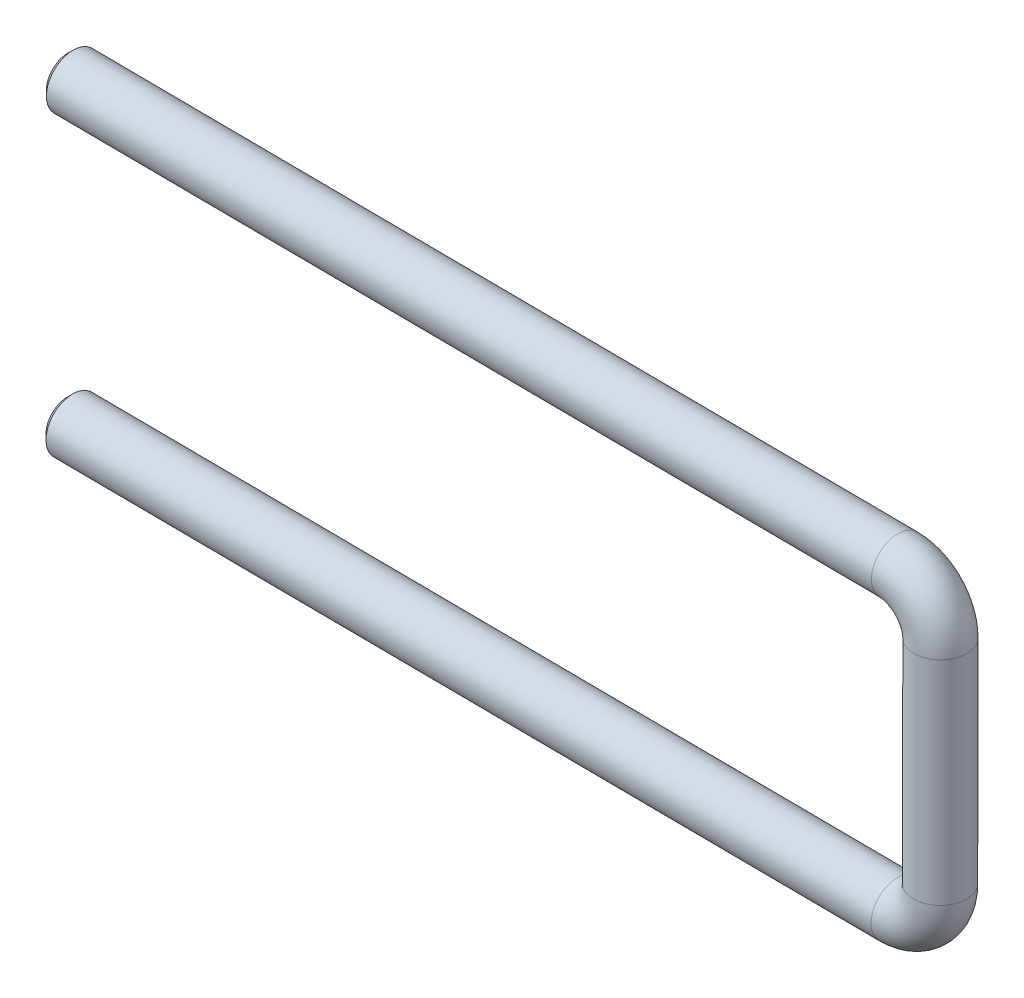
ISO-10303-21;
HEADER;
FILE_DESCRIPTION(('STEP AP214'),'2;1');
FILE_NAME('part.step','',(''),(''),'','','');
FILE_SCHEMA(('AUTOMOTIVE_DESIGN { 1 0 10303 214 1 1 1 1 }'));
ENDSEC;
DATA;
#1=APPLICATION_CONTEXT('core data for automotive mechanical design processes');
#2=APPLICATION_PROTOCOL_DEFINITION('international standard','automotive_design',2000,#1);
#3=PRODUCT_CONTEXT('',#1,'mechanical');
#4=PRODUCT('Part','Part','',(#3));
#5=PRODUCT_RELATED_PRODUCT_CATEGORY('part','',(#4));
#6=PRODUCT_DEFINITION_FORMATION('','',#4);
#7=PRODUCT_DEFINITION_CONTEXT('part definition',#1,'design');
#8=PRODUCT_DEFINITION('design','',#6,#7);
#9=PRODUCT_DEFINITION_SHAPE('','',#8);
#10=(LENGTH_UNIT() NAMED_UNIT(*) SI_UNIT(.MILLI.,.METRE.));
#11=(NAMED_UNIT(*) PLANE_ANGLE_UNIT() SI_UNIT($,.RADIAN.));
#12=(NAMED_UNIT(*) SI_UNIT($,.STERADIAN.) SOLID_ANGLE_UNIT());
#13=UNCERTAINTY_MEASURE_WITH_UNIT(LENGTH_MEASURE(1.E-05),#10,'distance_accuracy_value','');
#14=(GEOMETRIC_REPRESENTATION_CONTEXT(3) GLOBAL_UNCERTAINTY_ASSIGNED_CONTEXT((#13)) GLOBAL_UNIT_ASSIGNED_CONTEXT((#10,
#11,#12)) REPRESENTATION_CONTEXT('',''));
#15=CARTESIAN_POINT('',(0.,0.,0.));
#16=DIRECTION('',(0.,0.,1.));
#17=DIRECTION('',(1.,0.,0.));
#18=AXIS2_PLACEMENT_3D('',#15,#16,#17);
#19=CARTESIAN_POINT('',(-44.9011082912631,12.119800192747,16.0056169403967));
#20=DIRECTION('',(-0.999980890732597,0.0014045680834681,-0.00602041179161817));
#21=DIRECTION('',(-0.00602041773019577,0.,0.999981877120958));
#22=AXIS2_PLACEMENT_3D('',#19,#20,#21);
#23=PLANE('',#22);
#24=CARTESIAN_POINT('',(-44.9011082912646,12.119800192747,16.0056169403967));
#25=DIRECTION('',(0.999980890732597,-0.00140456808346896,0.00602041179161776));
#26=DIRECTION('',(0.00602041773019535,0.,-0.999981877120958));
#27=AXIS2_PLACEMENT_3D('',#24,#25,#26);
#28=CIRCLE('',#27,2.00000000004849);
#29=CARTESIAN_POINT('',(-44.8890674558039,12.119800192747,14.0056531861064));
#30=VERTEX_POINT('',#29);
#31=EDGE_CURVE('E16',#30,#30,#28,.T.);
#32=ORIENTED_EDGE('',*,*,#31,.F.);
#33=EDGE_LOOP('',(#32));
#34=FACE_BOUND('',#33,.T.);
#35=ADVANCED_FACE('F12',(#34),#23,.T.);
#36=CARTESIAN_POINT('',(-44.4011178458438,12.1190979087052,16.0086271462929));
#37=DIRECTION('',(0.999980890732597,-0.00140456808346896,0.00602041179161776));
#38=DIRECTION('',(0.00602041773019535,0.,-0.999981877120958));
#39=AXIS2_PLACEMENT_3D('',#36,#37,#38);
#40=CONICAL_SURFACE('',#39,2.50000000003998,0.785398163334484);
#41=CARTESIAN_POINT('',(-44.4011178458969,12.1190979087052,16.0086271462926));
#42=DIRECTION('',(-0.999980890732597,0.0014045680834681,-0.00602041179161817));
#43=DIRECTION('',(-0.00602041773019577,0.,0.999981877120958));
#44=AXIS2_PLACEMENT_3D('',#41,#42,#43);
#45=CIRCLE('',#44,2.5);
#46=CARTESIAN_POINT('',(-44.3860668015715,12.1190979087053,13.5086724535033));
#47=VERTEX_POINT('',#46);
#48=EDGE_CURVE('E37',#47,#47,#45,.F.);
#49=CARTESIAN_POINT('',(-44.3860668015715,12.1190979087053,13.5086724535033));
#50=CARTESIAN_POINT('',(-44.3913063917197,12.119105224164,13.5138493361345));
#51=CARTESIAN_POINT('',(-44.396545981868,12.1191125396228,13.5190262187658));
#52=CARTESIAN_POINT('',(-44.4070251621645,12.1191271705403,13.5293799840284));
#53=CARTESIAN_POINT('',(-44.4122647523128,12.1191344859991,13.5345568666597));
#54=CARTESIAN_POINT('',(-44.4227439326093,12.1191491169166,13.5449106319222));
#55=CARTESIAN_POINT('',(-44.4279835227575,12.1191564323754,13.5500875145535));
#56=CARTESIAN_POINT('',(-44.438462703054,12.1191710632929,13.5604412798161));
#57=CARTESIAN_POINT('',(-44.4437022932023,12.1191783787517,13.5656181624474));
#58=CARTESIAN_POINT('',(-44.4541814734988,12.1191930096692,13.5759719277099));
#59=CARTESIAN_POINT('',(-44.459421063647,12.119200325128,13.5811488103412));
#60=CARTESIAN_POINT('',(-44.4699002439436,12.1192149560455,13.5915025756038));
#61=CARTESIAN_POINT('',(-44.4751398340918,12.1192222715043,13.5966794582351));
#62=CARTESIAN_POINT('',(-44.4856190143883,12.1192369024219,13.6070332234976));
#63=CARTESIAN_POINT('',(-44.4908586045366,12.1192442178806,13.6122101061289));
#64=CARTESIAN_POINT('',(-44.5013377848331,12.1192588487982,13.6225638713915));
#65=CARTESIAN_POINT('',(-44.5065773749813,12.1192661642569,13.6277407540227));
#66=CARTESIAN_POINT('',(-44.5170565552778,12.1192807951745,13.6380945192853));
#67=CARTESIAN_POINT('',(-44.5222961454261,12.1192881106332,13.6432714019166));
#68=CARTESIAN_POINT('',(-44.5327753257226,12.1193027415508,13.6536251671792));
#69=CARTESIAN_POINT('',(-44.5380149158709,12.1193100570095,13.6588020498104));
#70=CARTESIAN_POINT('',(-44.5484940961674,12.1193246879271,13.669155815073));
#71=CARTESIAN_POINT('',(-44.5537336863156,12.1193320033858,13.6743326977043));
#72=CARTESIAN_POINT('',(-44.5642128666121,12.1193466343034,13.6846864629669));
#73=CARTESIAN_POINT('',(-44.5694524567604,12.1193539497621,13.6898633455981));
#74=CARTESIAN_POINT('',(-44.5799316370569,12.1193685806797,13.7002171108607));
#75=CARTESIAN_POINT('',(-44.5851712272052,12.1193758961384,13.705393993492));
#76=CARTESIAN_POINT('',(-44.5956504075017,12.119390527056,13.7157477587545));
#77=CARTESIAN_POINT('',(-44.6008899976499,12.1193978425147,13.7209246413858));
#78=CARTESIAN_POINT('',(-44.6113691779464,12.1194124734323,13.7312784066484));
#79=CARTESIAN_POINT('',(-44.6166087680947,12.1194197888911,13.7364552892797));
#80=CARTESIAN_POINT('',(-44.6270879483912,12.1194344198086,13.7468090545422));
#81=CARTESIAN_POINT('',(-44.6323275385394,12.1194417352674,13.7519859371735));
#82=CARTESIAN_POINT('',(-44.642806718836,12.1194563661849,13.7623397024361));
#83=CARTESIAN_POINT('',(-44.6480463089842,12.1194636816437,13.7675165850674));
#84=CARTESIAN_POINT('',(-44.6585254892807,12.1194783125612,13.7778703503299));
#85=CARTESIAN_POINT('',(-44.663765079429,12.11948562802,13.7830472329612));
#86=CARTESIAN_POINT('',(-44.6742442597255,12.1195002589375,13.7934009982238));
#87=CARTESIAN_POINT('',(-44.6794838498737,12.1195075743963,13.7985778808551));
#88=CARTESIAN_POINT('',(-44.6899630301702,12.1195222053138,13.8089316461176));
#89=CARTESIAN_POINT('',(-44.6952026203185,12.1195295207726,13.8141085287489));
#90=CARTESIAN_POINT('',(-44.705681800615,12.1195441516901,13.8244622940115));
#91=CARTESIAN_POINT('',(-44.7109213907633,12.1195514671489,13.8296391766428));
#92=CARTESIAN_POINT('',(-44.7214005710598,12.1195660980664,13.8399929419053));
#93=CARTESIAN_POINT('',(-44.726640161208,12.1195734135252,13.8451698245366));
#94=CARTESIAN_POINT('',(-44.7371193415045,12.1195880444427,13.8555235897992));
#95=CARTESIAN_POINT('',(-44.7423589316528,12.1195953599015,13.8607004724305));
#96=CARTESIAN_POINT('',(-44.7528381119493,12.119609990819,13.871054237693));
#97=CARTESIAN_POINT('',(-44.7580777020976,12.1196173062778,13.8762311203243));
#98=CARTESIAN_POINT('',(-44.7685568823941,12.1196319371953,13.8865848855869));
#99=CARTESIAN_POINT('',(-44.7737964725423,12.1196392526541,13.8917617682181));
#100=CARTESIAN_POINT('',(-44.7842756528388,12.1196538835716,13.9021155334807));
#101=CARTESIAN_POINT('',(-44.7895152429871,12.1196611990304,13.907292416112));
#102=CARTESIAN_POINT('',(-44.7999944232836,12.1196758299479,13.9176461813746));
#103=CARTESIAN_POINT('',(-44.8052340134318,12.1196831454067,13.9228230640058));
#104=CARTESIAN_POINT('',(-44.8157131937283,12.1196977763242,13.9331768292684));
#105=CARTESIAN_POINT('',(-44.8209527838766,12.119705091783,13.9383537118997));
#106=CARTESIAN_POINT('',(-44.8314319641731,12.1197197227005,13.9487074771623));
#107=CARTESIAN_POINT('',(-44.8366715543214,12.1197270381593,13.9538843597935));
#108=CARTESIAN_POINT('',(-44.8471507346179,12.1197416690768,13.9642381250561));
#109=CARTESIAN_POINT('',(-44.8523903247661,12.1197489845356,13.9694150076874));
#110=CARTESIAN_POINT('',(-44.8628695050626,12.1197636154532,13.97976877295));
#111=CARTESIAN_POINT('',(-44.8681090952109,12.1197709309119,13.9849456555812));
#112=CARTESIAN_POINT('',(-44.8785882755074,12.1197855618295,13.9952994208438));
#113=CARTESIAN_POINT('',(-44.8838278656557,12.1197928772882,14.0004763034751));
#114=CARTESIAN_POINT('',(-44.8890674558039,12.119800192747,14.0056531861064));
#115=B_SPLINE_CURVE_WITH_KNOTS('',3,(#49,#50,#51,#52,#53,#54,#55,#56,#57,#58,#59,#60,#61,#62,
#63,#64,#65,#66,#67,#68,#69,#70,#71,#72,#73,#74,#75,#76,#77,#78,#79,#80,#81,#82,#83,#84,#85,#86,
#87,#88,#89,#90,#91,#92,#93,#94,#95,#96,#97,#98,#99,#100,#101,#102,#103,#104,#105,#106,#107,
#108,#109,#110,#111,#112,#113,#114),.UNSPECIFIED.,.F.,.F.,(4,2,2,2,2,2,2,2,2,2,2,2,2,2,2,2,2,2,
2,2,2,2,2,2,2,2,2,2,2,2,2,2,4),(0.,0.0220970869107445,0.0441941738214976,0.0662912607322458,
0.0883883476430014,0.11048543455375,0.132582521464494,0.154679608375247,0.176776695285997,
0.198873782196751,0.220970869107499,0.24306795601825,0.265165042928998,0.287262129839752,
0.309359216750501,0.331456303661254,0.353553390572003,0.375650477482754,0.397747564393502,
0.419844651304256,0.441941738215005,0.464038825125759,0.486135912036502,0.508232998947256,
0.530330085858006,0.55242717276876,0.574524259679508,0.596621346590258,0.618718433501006,
0.64081552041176,0.66291260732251,0.685009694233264,0.707106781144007),.UNSPECIFIED.);
#116=EDGE_CURVE('BSEAM110',#47,#30,#115,.T.);
#117=ORIENTED_EDGE('',*,*,#48,.F.);
#118=ORIENTED_EDGE('',*,*,#31,.T.);
#119=ORIENTED_EDGE('',*,*,#116,.T.);
#120=ORIENTED_EDGE('',*,*,#116,.F.);
#121=EDGE_LOOP('',(#117,#119,#118,#120));
#122=FACE_BOUND('',#121,.T.);
#123=ADVANCED_FACE('F110',(#122),#40,.T.);
#124=CARTESIAN_POINT('',(33.5973916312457,12.0095415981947,16.4782192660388));
#125=DIRECTION('',(-0.999980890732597,0.0014045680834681,-0.00602041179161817));
#126=DIRECTION('',(-0.00602041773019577,0.,0.999981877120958));
#127=AXIS2_PLACEMENT_3D('',#124,#125,#126);
#128=CYLINDRICAL_SURFACE('',#127,2.5);
#129=ORIENTED_EDGE('',*,*,#48,.T.);
#130=EDGE_LOOP('',(#129));
#131=FACE_BOUND('',#130,.T.);
#132=CARTESIAN_POINT('',(33.5973916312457,12.0095415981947,16.4782192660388));
#133=DIRECTION('',(0.999980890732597,-0.00140456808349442,0.00602041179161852));
#134=DIRECTION('',(0.00602041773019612,0.,-0.999981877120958));
#135=AXIS2_PLACEMENT_3D('',#132,#133,#134);
#136=CIRCLE('',#135,2.5);
#137=CARTESIAN_POINT('',(33.5938801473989,9.50954406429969,16.4782192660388));
#138=VERTEX_POINT('',#137);
#139=EDGE_CURVE('E34',#138,#138,#136,.T.);
#140=ORIENTED_EDGE('',*,*,#139,.F.);
#141=EDGE_LOOP('',(#140));
#142=FACE_BOUND('',#141,.T.);
#143=ADVANCED_FACE('F101',(#131,#142),#128,.T.);
#144=CARTESIAN_POINT('',(33.6030100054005,16.0095376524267,16.4782192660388));
#145=DIRECTION('',(-0.00602040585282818,8.45623149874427E-06,0.999981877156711));
#146=DIRECTION('',(0.999981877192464,0.,0.00602040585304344));
#147=AXIS2_PLACEMENT_3D('',#144,#145,#146);
#148=TOROIDAL_SURFACE('',#147,4.,2.5);
#149=CARTESIAN_POINT('',(37.6029335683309,16.0039193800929,16.5023009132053));
#150=DIRECTION('',(0.00140459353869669,0.999999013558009,0.));
#151=DIRECTION('',(-0.999999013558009,0.00140459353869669,0.));
#152=AXIS2_PLACEMENT_3D('',#149,#150,#151);
#153=CIRCLE('',#152,2.5);
#154=CARTESIAN_POINT('',(40.1028857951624,16.0004079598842,16.5173519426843));
#155=VERTEX_POINT('',#154);
#156=EDGE_CURVE('E31',#155,#155,#153,.T.);
#157=CARTESIAN_POINT('',(33.6030100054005,16.0095376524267,16.4782192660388));
#158=DIRECTION('',(-0.00602040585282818,8.45623149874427E-06,0.999981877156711));
#159=DIRECTION('',(0.999981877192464,0.,0.00602040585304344));
#160=AXIS2_PLACEMENT_3D('',#157,#158,#159);
#161=CIRCLE('',#160,6.5);
#162=EDGE_CURVE('',#138,#155,#161,.T.);
#163=ORIENTED_EDGE('',*,*,#139,.T.);
#164=ORIENTED_EDGE('',*,*,#156,.F.);
#165=ORIENTED_EDGE('',*,*,#162,.T.);
#166=ORIENTED_EDGE('',*,*,#162,.F.);
#167=EDGE_LOOP('',(#163,#165,#164,#166));
#168=FACE_BOUND('',#167,.T.);
#169=ADVANCED_FACE('F55',(#168),#148,.T.);
#170=CARTESIAN_POINT('',(37.6029335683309,16.0039193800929,16.5023009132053));
#171=DIRECTION('',(0.00140459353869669,0.999999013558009,0.));
#172=DIRECTION('',(-0.999999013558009,0.00140459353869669,0.));
#173=AXIS2_PLACEMENT_3D('',#170,#171,#172);
#174=CYLINDRICAL_SURFACE('',#173,2.5);
#175=CARTESIAN_POINT('',(37.6310254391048,36.0038996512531,16.5023009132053));
#176=DIRECTION('',(0.00140459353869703,0.999999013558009,0.));
#177=DIRECTION('',(-0.999999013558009,0.00140459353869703,0.));
#178=AXIS2_PLACEMENT_3D('',#175,#176,#177);
#179=CIRCLE('',#178,2.5);
#180=CARTESIAN_POINT('',(40.1309776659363,36.0003882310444,16.5173519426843));
#181=VERTEX_POINT('',#180);
#182=EDGE_CURVE('E28',#181,#181,#179,.T.);
#183=ORIENTED_EDGE('',*,*,#182,.F.);
#184=EDGE_LOOP('',(#183));
#185=FACE_BOUND('',#184,.T.);
#186=ORIENTED_EDGE('',*,*,#156,.T.);
#187=EDGE_LOOP('',(#186));
#188=FACE_BOUND('',#187,.T.);
#189=ADVANCED_FACE('F46',(#185,#188),#174,.T.);
#190=CARTESIAN_POINT('',(-44.8617796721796,40.1197725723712,16.0056169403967));
#191=DIRECTION('',(0.999980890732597,-0.00140456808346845,0.00602041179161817));
#192=DIRECTION('',(0.00602041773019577,0.,-0.999981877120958));
#193=AXIS2_PLACEMENT_3D('',#190,#191,#192);
#194=PLANE('',#193);
#195=CARTESIAN_POINT('',(-44.8617796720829,40.1197725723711,16.0056169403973));
#196=DIRECTION('',(0.999980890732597,-0.00140456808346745,0.00602041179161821));
#197=DIRECTION('',(0.00602041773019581,0.,-0.999981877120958));
#198=AXIS2_PLACEMENT_3D('',#195,#196,#197);
#199=CIRCLE('',#198,2.00000000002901);
#200=CARTESIAN_POINT('',(-44.8497388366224,40.1197725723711,14.0056531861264));
#201=VERTEX_POINT('',#200);
#202=EDGE_CURVE('E25',#201,#201,#199,.T.);
#203=ORIENTED_EDGE('',*,*,#202,.F.);
#204=EDGE_LOOP('',(#203));
#205=FACE_BOUND('',#204,.T.);
#206=ADVANCED_FACE('F44',(#205),#194,.F.);
#207=CARTESIAN_POINT('',(33.6311018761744,36.009517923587,16.4782192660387));
#208=DIRECTION('',(-0.00602040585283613,8.45623149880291E-06,0.999981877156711));
#209=DIRECTION('',(0.999981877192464,0.,0.00602040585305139));
#210=AXIS2_PLACEMENT_3D('',#207,#208,#209);
#211=TOROIDAL_SURFACE('',#210,4.,2.5);
#212=CARTESIAN_POINT('',(33.6367202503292,40.009513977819,16.4782192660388));
#213=DIRECTION('',(-0.999980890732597,0.0014045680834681,-0.00602041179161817));
#214=DIRECTION('',(-0.00602041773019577,0.,0.999981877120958));
#215=AXIS2_PLACEMENT_3D('',#212,#213,#214);
#216=CIRCLE('',#215,2.5);
#217=CARTESIAN_POINT('',(33.640231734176,42.509511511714,16.4782192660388));
#218=VERTEX_POINT('',#217);
#219=EDGE_CURVE('E20',#218,#218,#216,.T.);
#220=CARTESIAN_POINT('',(33.6311018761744,36.009517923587,16.4782192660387));
#221=DIRECTION('',(-0.00602040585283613,8.45623149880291E-06,0.999981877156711));
#222=DIRECTION('',(0.999981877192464,0.,0.00602040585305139));
#223=AXIS2_PLACEMENT_3D('',#220,#221,#222);
#224=CIRCLE('',#223,6.5);
#225=EDGE_CURVE('',#181,#218,#224,.T.);
#226=ORIENTED_EDGE('',*,*,#182,.T.);
#227=ORIENTED_EDGE('',*,*,#219,.F.);
#228=ORIENTED_EDGE('',*,*,#225,.T.);
#229=ORIENTED_EDGE('',*,*,#225,.F.);
#230=EDGE_LOOP('',(#226,#228,#227,#229));
#231=FACE_BOUND('',#230,.T.);
#232=ADVANCED_FACE('F14',(#231),#211,.T.);
#233=CARTESIAN_POINT('',(-44.3617892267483,40.1190702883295,16.0086271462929));
#234=DIRECTION('',(0.999980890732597,-0.00140456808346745,0.00602041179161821));
#235=DIRECTION('',(0.00602041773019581,0.,-0.999981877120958));
#236=AXIS2_PLACEMENT_3D('',#233,#234,#235);
#237=CONICAL_SURFACE('',#236,2.50000000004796,0.785398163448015);
#238=CARTESIAN_POINT('',(-44.3617892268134,40.1190702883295,16.0086271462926));
#239=DIRECTION('',(-0.999980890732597,0.0014045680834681,-0.00602041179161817));
#240=DIRECTION('',(-0.00602041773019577,0.,0.999981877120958));
#241=AXIS2_PLACEMENT_3D('',#238,#239,#240);
#242=CIRCLE('',#241,2.5);
#243=CARTESIAN_POINT('',(-44.346738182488,40.1190702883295,13.5086724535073));
#244=VERTEX_POINT('',#243);
#245=EDGE_CURVE('E8',#244,#244,#242,.F.);
#246=CARTESIAN_POINT('',(-44.346738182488,40.1190702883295,13.5086724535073));
#247=CARTESIAN_POINT('',(-44.3519777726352,40.1190776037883,13.5138493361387));
#248=CARTESIAN_POINT('',(-44.3572173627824,40.1190849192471,13.5190262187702));
#249=CARTESIAN_POINT('',(-44.3676965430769,40.1190995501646,13.5293799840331));
#250=CARTESIAN_POINT('',(-44.3729361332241,40.1191068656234,13.5345568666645));
#251=CARTESIAN_POINT('',(-44.3834153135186,40.1191214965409,13.5449106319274));
#252=CARTESIAN_POINT('',(-44.3886549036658,40.1191288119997,13.5500875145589));
#253=CARTESIAN_POINT('',(-44.3991340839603,40.1191434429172,13.5604412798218));
#254=CARTESIAN_POINT('',(-44.4043736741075,40.119150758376,13.5656181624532));
#255=CARTESIAN_POINT('',(-44.414852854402,40.1191653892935,13.5759719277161));
#256=CARTESIAN_POINT('',(-44.4200924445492,40.1191727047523,13.5811488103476));
#257=CARTESIAN_POINT('',(-44.4305716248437,40.1191873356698,13.5915025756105));
#258=CARTESIAN_POINT('',(-44.4358112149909,40.1191946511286,13.5966794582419));
#259=CARTESIAN_POINT('',(-44.4462903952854,40.1192092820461,13.6070332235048));
#260=CARTESIAN_POINT('',(-44.4515299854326,40.1192165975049,13.6122101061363));
#261=CARTESIAN_POINT('',(-44.4620091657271,40.1192312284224,13.6225638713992));
#262=CARTESIAN_POINT('',(-44.4672487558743,40.1192385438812,13.6277407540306));
#263=CARTESIAN_POINT('',(-44.4777279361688,40.1192531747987,13.6380945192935));
#264=CARTESIAN_POINT('',(-44.482967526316,40.1192604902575,13.643271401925));
#265=CARTESIAN_POINT('',(-44.4934467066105,40.119275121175,13.6536251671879));
#266=CARTESIAN_POINT('',(-44.4986862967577,40.1192824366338,13.6588020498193));
#267=CARTESIAN_POINT('',(-44.5091654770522,40.1192970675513,13.6691558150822));
#268=CARTESIAN_POINT('',(-44.5144050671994,40.1193043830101,13.6743326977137));
#269=CARTESIAN_POINT('',(-44.5248842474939,40.1193190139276,13.6846864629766));
#270=CARTESIAN_POINT('',(-44.5301238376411,40.1193263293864,13.689863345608));
#271=CARTESIAN_POINT('',(-44.5406030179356,40.1193409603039,13.7002171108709));
#272=CARTESIAN_POINT('',(-44.5458426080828,40.1193482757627,13.7053939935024));
#273=CARTESIAN_POINT('',(-44.5563217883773,40.1193629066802,13.7157477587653));
#274=CARTESIAN_POINT('',(-44.5615613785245,40.119370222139,13.7209246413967));
#275=CARTESIAN_POINT('',(-44.572040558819,40.1193848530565,13.7312784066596));
#276=CARTESIAN_POINT('',(-44.5772801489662,40.1193921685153,13.7364552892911));
#277=CARTESIAN_POINT('',(-44.5877593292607,40.1194067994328,13.746809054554));
#278=CARTESIAN_POINT('',(-44.5929989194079,40.1194141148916,13.7519859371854));
#279=CARTESIAN_POINT('',(-44.6034780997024,40.1194287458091,13.7623397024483));
#280=CARTESIAN_POINT('',(-44.6087176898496,40.1194360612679,13.7675165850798));
#281=CARTESIAN_POINT('',(-44.6191968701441,40.1194506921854,13.7778703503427));
#282=CARTESIAN_POINT('',(-44.6244364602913,40.1194580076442,13.7830472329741));
#283=CARTESIAN_POINT('',(-44.6349156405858,40.1194726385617,13.793400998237));
#284=CARTESIAN_POINT('',(-44.640155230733,40.1194799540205,13.7985778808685));
#285=CARTESIAN_POINT('',(-44.6506344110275,40.119494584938,13.8089316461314));
#286=CARTESIAN_POINT('',(-44.6558740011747,40.1195019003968,13.8141085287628));
#287=CARTESIAN_POINT('',(-44.6663531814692,40.1195165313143,13.8244622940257));
#288=CARTESIAN_POINT('',(-44.6715927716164,40.1195238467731,13.8296391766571));
#289=CARTESIAN_POINT('',(-44.6820719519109,40.1195384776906,13.83999294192));
#290=CARTESIAN_POINT('',(-44.6873115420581,40.1195457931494,13.8451698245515));
#291=CARTESIAN_POINT('',(-44.6977907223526,40.1195604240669,13.8555235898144));
#292=CARTESIAN_POINT('',(-44.7030303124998,40.1195677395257,13.8607004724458));
#293=CARTESIAN_POINT('',(-44.7135094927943,40.1195823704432,13.8710542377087));
#294=CARTESIAN_POINT('',(-44.7187490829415,40.119589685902,13.8762311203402));
#295=CARTESIAN_POINT('',(-44.729228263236,40.1196043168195,13.8865848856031));
#296=CARTESIAN_POINT('',(-44.7344678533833,40.1196116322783,13.8917617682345));
#297=CARTESIAN_POINT('',(-44.7449470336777,40.1196262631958,13.9021155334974));
#298=CARTESIAN_POINT('',(-44.750186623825,40.1196335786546,13.9072924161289));
#299=CARTESIAN_POINT('',(-44.7606658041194,40.1196482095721,13.9176461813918));
#300=CARTESIAN_POINT('',(-44.7659053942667,40.1196555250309,13.9228230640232));
#301=CARTESIAN_POINT('',(-44.7763845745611,40.1196701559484,13.9331768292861));
#302=CARTESIAN_POINT('',(-44.7816241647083,40.1196774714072,13.9383537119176));
#303=CARTESIAN_POINT('',(-44.7921033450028,40.1196921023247,13.9487074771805));
#304=CARTESIAN_POINT('',(-44.79734293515,40.1196994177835,13.9538843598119));
#305=CARTESIAN_POINT('',(-44.8078221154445,40.119714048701,13.9642381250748));
#306=CARTESIAN_POINT('',(-44.8130617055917,40.1197213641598,13.9694150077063));
#307=CARTESIAN_POINT('',(-44.8235408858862,40.1197359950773,13.9797687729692));
#308=CARTESIAN_POINT('',(-44.8287804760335,40.1197433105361,13.9849456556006));
#309=CARTESIAN_POINT('',(-44.8392596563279,40.1197579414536,13.9952994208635));
#310=CARTESIAN_POINT('',(-44.8444992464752,40.1197652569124,14.000476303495));
#311=CARTESIAN_POINT('',(-44.8497388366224,40.1197725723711,14.0056531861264));
#312=B_SPLINE_CURVE_WITH_KNOTS('',3,(#246,#247,#248,#249,#250,#251,#252,#253,#254,#255,#256,
#257,#258,#259,#260,#261,#262,#263,#264,#265,#266,#267,#268,#269,#270,#271,#272,#273,#274,#275,
#276,#277,#278,#279,#280,#281,#282,#283,#284,#285,#286,#287,#288,#289,#290,#291,#292,#293,#294,
#295,#296,#297,#298,#299,#300,#301,#302,#303,#304,#305,#306,#307,#308,#309,#310,#311),
.UNSPECIFIED.,.F.,.F.,(4,2,2,2,2,2,2,2,2,2,2,2,2,2,2,2,2,2,2,2,2,2,2,2,2,2,2,2,2,2,2,2,4),(0.,
0.0220970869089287,0.0441941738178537,0.0662912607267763,0.0883883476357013,0.11048543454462,
0.132582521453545,0.154679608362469,0.176776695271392,0.198873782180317,0.22097086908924,
0.243067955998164,0.265165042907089,0.287262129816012,0.309359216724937,0.33145630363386,
0.353553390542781,0.375650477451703,0.397747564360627,0.419844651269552,0.441941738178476,
0.464038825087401,0.486135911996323,0.508232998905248,0.530330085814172,0.552427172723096,
0.574524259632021,0.596621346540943,0.618718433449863,0.640815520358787,0.662912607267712,
0.685009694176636,0.707106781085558),.UNSPECIFIED.);
#313=EDGE_CURVE('BSEAM42',#244,#201,#312,.T.);
#314=ORIENTED_EDGE('',*,*,#245,.F.);
#315=ORIENTED_EDGE('',*,*,#202,.T.);
#316=ORIENTED_EDGE('',*,*,#313,.T.);
#317=ORIENTED_EDGE('',*,*,#313,.F.);
#318=EDGE_LOOP('',(#314,#316,#315,#317));
#319=FACE_BOUND('',#318,.T.);
#320=ADVANCED_FACE('F42',(#319),#237,.T.);
#321=CARTESIAN_POINT('',(33.6367202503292,40.009513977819,16.4782192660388));
#322=DIRECTION('',(-0.999980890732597,0.0014045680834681,-0.00602041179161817));
#323=DIRECTION('',(-0.00602041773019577,0.,0.999981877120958));
#324=AXIS2_PLACEMENT_3D('',#321,#322,#323);
#325=CYLINDRICAL_SURFACE('',#324,2.5);
#326=ORIENTED_EDGE('',*,*,#245,.T.);
#327=EDGE_LOOP('',(#326));
#328=FACE_BOUND('',#327,.T.);
#329=ORIENTED_EDGE('',*,*,#219,.T.);
#330=EDGE_LOOP('',(#329));
#331=FACE_BOUND('',#330,.T.);
#332=ADVANCED_FACE('F59',(#328,#331),#325,.T.);
#333=CLOSED_SHELL('',(#35,#123,#143,#169,#189,#206,#232,#320,#332));
#334=MANIFOLD_SOLID_BREP('B1',#333);
#335=ADVANCED_BREP_SHAPE_REPRESENTATION('',(#18,#334),#14);
#336=SHAPE_DEFINITION_REPRESENTATION(#9,#335);
ENDSEC;
END-ISO-10303-21;
